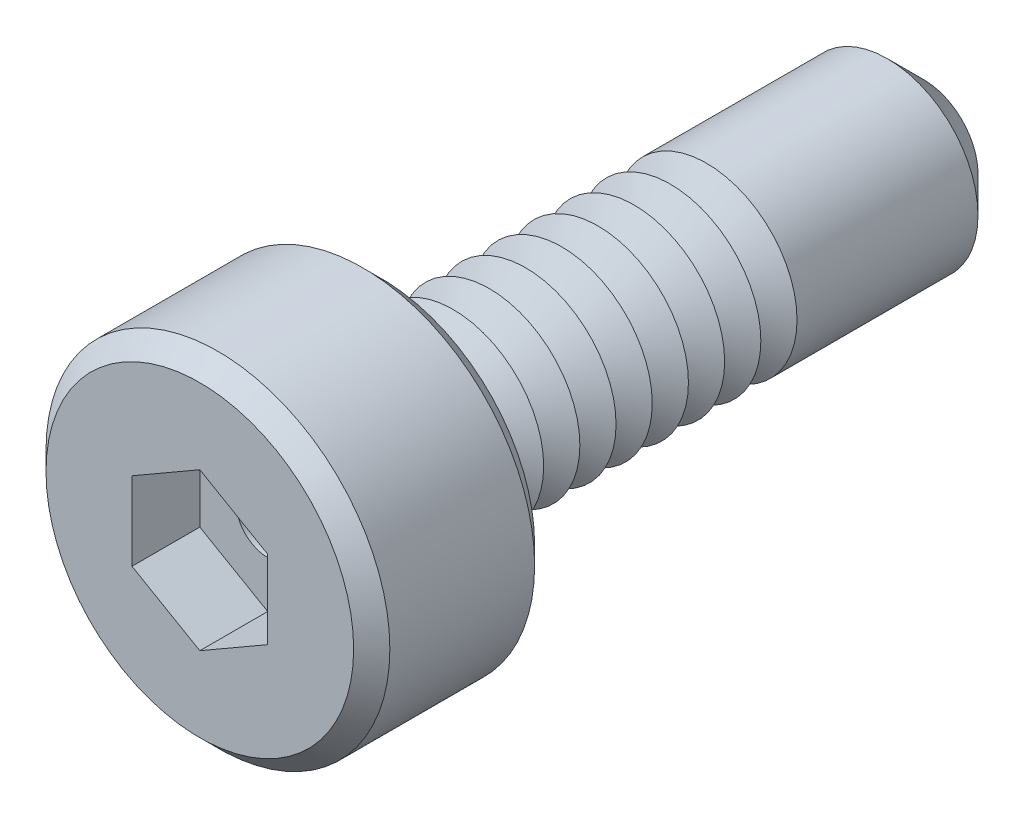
ISO-10303-21;
HEADER;
FILE_DESCRIPTION(('STEP AP214'),'2;1');
FILE_NAME('part.step','',(''),(''),'','','');
FILE_SCHEMA(('AUTOMOTIVE_DESIGN { 1 0 10303 214 1 1 1 1 }'));
ENDSEC;
DATA;
#1=APPLICATION_CONTEXT('core data for automotive mechanical design processes');
#2=APPLICATION_PROTOCOL_DEFINITION('international standard','automotive_design',2000,#1);
#3=PRODUCT_CONTEXT('',#1,'mechanical');
#4=PRODUCT('Part','Part','',(#3));
#5=PRODUCT_RELATED_PRODUCT_CATEGORY('part','',(#4));
#6=PRODUCT_DEFINITION_FORMATION('','',#4);
#7=PRODUCT_DEFINITION_CONTEXT('part definition',#1,'design');
#8=PRODUCT_DEFINITION('design','',#6,#7);
#9=PRODUCT_DEFINITION_SHAPE('','',#8);
#10=(LENGTH_UNIT() NAMED_UNIT(*) SI_UNIT(.MILLI.,.METRE.));
#11=(NAMED_UNIT(*) PLANE_ANGLE_UNIT() SI_UNIT($,.RADIAN.));
#12=(NAMED_UNIT(*) SI_UNIT($,.STERADIAN.) SOLID_ANGLE_UNIT());
#13=UNCERTAINTY_MEASURE_WITH_UNIT(LENGTH_MEASURE(1.E-05),#10,'distance_accuracy_value','');
#14=(GEOMETRIC_REPRESENTATION_CONTEXT(3) GLOBAL_UNCERTAINTY_ASSIGNED_CONTEXT((#13)) GLOBAL_UNIT_ASSIGNED_CONTEXT((#10,
#11,#12)) REPRESENTATION_CONTEXT('',''));
#15=CARTESIAN_POINT('',(0.,0.,0.));
#16=DIRECTION('',(0.,0.,1.));
#17=DIRECTION('',(1.,0.,0.));
#18=AXIS2_PLACEMENT_3D('',#15,#16,#17);
#19=CARTESIAN_POINT('',(0.,0.,2.));
#20=DIRECTION('',(0.,0.,-1.));
#21=DIRECTION('',(-1.,0.,0.));
#22=AXIS2_PLACEMENT_3D('',#19,#20,#21);
#23=CYLINDRICAL_SURFACE('',#22,1.9);
#24=CARTESIAN_POINT('',(0.,0.,0.2));
#25=DIRECTION('',(0.,0.,1.));
#26=DIRECTION('',(1.,0.,0.));
#27=AXIS2_PLACEMENT_3D('',#24,#25,#26);
#28=CIRCLE('',#27,1.9);
#29=CARTESIAN_POINT('',(1.9,0.,0.2));
#30=VERTEX_POINT('',#29);
#31=EDGE_CURVE('E252',#30,#30,#28,.T.);
#32=ORIENTED_EDGE('',*,*,#31,.T.);
#33=EDGE_LOOP('',(#32));
#34=FACE_BOUND('',#33,.T.);
#35=CARTESIAN_POINT('',(0.,0.,1.8));
#36=DIRECTION('',(0.,0.,1.));
#37=DIRECTION('',(1.,0.,0.));
#38=AXIS2_PLACEMENT_3D('',#35,#36,#37);
#39=CIRCLE('',#38,1.9);
#40=CARTESIAN_POINT('',(1.9,0.,1.8));
#41=VERTEX_POINT('',#40);
#42=EDGE_CURVE('E248',#41,#41,#39,.F.);
#43=ORIENTED_EDGE('',*,*,#42,.T.);
#44=EDGE_LOOP('',(#43));
#45=FACE_BOUND('',#44,.T.);
#46=ADVANCED_FACE('F39',(#34,#45),#23,.T.);
#47=CARTESIAN_POINT('',(0.,0.,2.));
#48=DIRECTION('',(0.,0.,1.));
#49=DIRECTION('',(1.,0.,0.));
#50=AXIS2_PLACEMENT_3D('',#47,#48,#49);
#51=PLANE('',#50);
#52=CARTESIAN_POINT('',(0.,0.,2.));
#53=DIRECTION('',(0.,0.,1.));
#54=DIRECTION('',(1.,0.,0.));
#55=AXIS2_PLACEMENT_3D('',#52,#53,#54);
#56=CIRCLE('',#55,1.7);
#57=CARTESIAN_POINT('',(1.7,0.,2.));
#58=VERTEX_POINT('',#57);
#59=EDGE_CURVE('E11',#58,#58,#56,.T.);
#60=ORIENTED_EDGE('',*,*,#59,.T.);
#61=EDGE_LOOP('',(#60));
#62=FACE_BOUND('',#61,.T.);
#63=DIRECTION('',(-0.866025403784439,0.5,0.));
#64=VECTOR('',#63,1.);
#65=CARTESIAN_POINT('',(0.749999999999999,0.433012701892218,2.));
#66=LINE('',#65,#64);
#67=CARTESIAN_POINT('',(0.749999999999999,0.433012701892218,2.));
#68=VERTEX_POINT('',#67);
#69=CARTESIAN_POINT('',(0.,0.866025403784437,2.));
#70=VERTEX_POINT('',#69);
#71=EDGE_CURVE('E55',#68,#70,#66,.T.);
#72=ORIENTED_EDGE('',*,*,#71,.F.);
#73=DIRECTION('',(0.,1.,0.));
#74=VECTOR('',#73,1.);
#75=CARTESIAN_POINT('',(0.75,-0.433012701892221,2.));
#76=LINE('',#75,#74);
#77=CARTESIAN_POINT('',(0.75,-0.433012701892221,2.));
#78=VERTEX_POINT('',#77);
#79=EDGE_CURVE('E150',#78,#68,#76,.T.);
#80=ORIENTED_EDGE('',*,*,#79,.F.);
#81=DIRECTION('',(0.866025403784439,0.5,0.));
#82=VECTOR('',#81,1.);
#83=CARTESIAN_POINT('',(0.,-0.86602540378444,2.));
#84=LINE('',#83,#82);
#85=CARTESIAN_POINT('',(0.,-0.86602540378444,2.));
#86=VERTEX_POINT('',#85);
#87=EDGE_CURVE('E147',#86,#78,#84,.T.);
#88=ORIENTED_EDGE('',*,*,#87,.F.);
#89=DIRECTION('',(0.866025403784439,-0.5,0.));
#90=VECTOR('',#89,1.);
#91=CARTESIAN_POINT('',(-0.75,-0.433012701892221,2.));
#92=LINE('',#91,#90);
#93=CARTESIAN_POINT('',(-0.75,-0.433012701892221,2.));
#94=VERTEX_POINT('',#93);
#95=EDGE_CURVE('E103',#94,#86,#92,.T.);
#96=ORIENTED_EDGE('',*,*,#95,.F.);
#97=DIRECTION('',(0.,-1.,0.));
#98=VECTOR('',#97,1.);
#99=CARTESIAN_POINT('',(-0.75,0.433012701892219,2.));
#100=LINE('',#99,#98);
#101=CARTESIAN_POINT('',(-0.75,0.433012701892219,2.));
#102=VERTEX_POINT('',#101);
#103=EDGE_CURVE('E141',#102,#94,#100,.T.);
#104=ORIENTED_EDGE('',*,*,#103,.F.);
#105=DIRECTION('',(-0.866025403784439,-0.499999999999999,0.));
#106=VECTOR('',#105,1.);
#107=CARTESIAN_POINT('',(0.,0.866025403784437,2.));
#108=LINE('',#107,#106);
#109=EDGE_CURVE('E136',#70,#102,#108,.T.);
#110=ORIENTED_EDGE('',*,*,#109,.F.);
#111=EDGE_LOOP('',(#72,#80,#88,#96,#104,#110));
#112=FACE_BOUND('',#111,.T.);
#113=ADVANCED_FACE('F270',(#62,#112),#51,.T.);
#114=CARTESIAN_POINT('',(0.,0.,0.));
#115=DIRECTION('',(0.,0.,1.));
#116=DIRECTION('',(1.,0.,0.));
#117=AXIS2_PLACEMENT_3D('',#114,#115,#116);
#118=PLANE('',#117);
#119=CARTESIAN_POINT('',(0.,0.,0.));
#120=DIRECTION('',(0.,0.,1.));
#121=DIRECTION('',(1.,0.,0.));
#122=AXIS2_PLACEMENT_3D('',#119,#120,#121);
#123=CIRCLE('',#122,1.7);
#124=CARTESIAN_POINT('',(1.7,0.,0.));
#125=VERTEX_POINT('',#124);
#126=EDGE_CURVE('E48',#125,#125,#123,.F.);
#127=ORIENTED_EDGE('',*,*,#126,.T.);
#128=EDGE_LOOP('',(#127));
#129=FACE_BOUND('',#128,.T.);
#130=CARTESIAN_POINT('',(0.,0.,0.));
#131=DIRECTION('',(0.,0.,1.));
#132=DIRECTION('',(1.,0.,0.));
#133=AXIS2_PLACEMENT_3D('',#130,#131,#132);
#134=CIRCLE('',#133,1.);
#135=CARTESIAN_POINT('',(1.,0.,0.));
#136=VERTEX_POINT('',#135);
#137=EDGE_CURVE('E237',#136,#136,#134,.T.);
#138=ORIENTED_EDGE('',*,*,#137,.T.);
#139=EDGE_LOOP('',(#138));
#140=FACE_BOUND('',#139,.T.);
#141=ADVANCED_FACE('F259',(#129,#140),#118,.F.);
#142=CARTESIAN_POINT('',(0.,0.,0.));
#143=DIRECTION('',(0.,0.,1.));
#144=DIRECTION('',(1.,0.,0.));
#145=AXIS2_PLACEMENT_3D('',#142,#143,#144);
#146=CONICAL_SURFACE('',#145,1.,1.0471975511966);
#147=CARTESIAN_POINT('',(0.,0.,-0.200000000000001));
#148=DIRECTION('',(0.,0.,1.));
#149=DIRECTION('',(1.,0.,0.));
#150=AXIS2_PLACEMENT_3D('',#147,#148,#149);
#151=CIRCLE('',#150,0.653589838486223);
#152=CARTESIAN_POINT('',(0.653589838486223,0.,-0.200000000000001));
#153=VERTEX_POINT('',#152);
#154=EDGE_CURVE('E233',#153,#153,#151,.T.);
#155=ORIENTED_EDGE('',*,*,#154,.T.);
#156=EDGE_LOOP('',(#155));
#157=FACE_BOUND('',#156,.T.);
#158=ORIENTED_EDGE('',*,*,#137,.F.);
#159=EDGE_LOOP('',(#158));
#160=FACE_BOUND('',#159,.T.);
#161=ADVANCED_FACE('F392',(#157,#160),#146,.T.);
#162=CARTESIAN_POINT('',(0.,0.,-0.200000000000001));
#163=DIRECTION('',(0.,0.,-1.));
#164=DIRECTION('',(-1.,0.,0.));
#165=AXIS2_PLACEMENT_3D('',#162,#163,#164);
#166=CONICAL_SURFACE('',#165,0.653589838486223,1.0471975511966);
#167=CARTESIAN_POINT('',(0.,0.,-0.4));
#168=DIRECTION('',(0.,0.,1.));
#169=DIRECTION('',(1.,0.,0.));
#170=AXIS2_PLACEMENT_3D('',#167,#168,#169);
#171=CIRCLE('',#170,1.);
#172=CARTESIAN_POINT('',(1.,0.,-0.4));
#173=VERTEX_POINT('',#172);
#174=EDGE_CURVE('E229',#173,#173,#171,.T.);
#175=ORIENTED_EDGE('',*,*,#174,.T.);
#176=EDGE_LOOP('',(#175));
#177=FACE_BOUND('',#176,.T.);
#178=ORIENTED_EDGE('',*,*,#154,.F.);
#179=EDGE_LOOP('',(#178));
#180=FACE_BOUND('',#179,.T.);
#181=ADVANCED_FACE('F388',(#177,#180),#166,.T.);
#182=CARTESIAN_POINT('',(0.,0.,-0.4));
#183=DIRECTION('',(0.,0.,1.));
#184=DIRECTION('',(1.,0.,0.));
#185=AXIS2_PLACEMENT_3D('',#182,#183,#184);
#186=CONICAL_SURFACE('',#185,1.,1.0471975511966);
#187=CARTESIAN_POINT('',(0.,0.,-0.600000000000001));
#188=DIRECTION('',(0.,0.,1.));
#189=DIRECTION('',(1.,0.,0.));
#190=AXIS2_PLACEMENT_3D('',#187,#188,#189);
#191=CIRCLE('',#190,0.653589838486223);
#192=CARTESIAN_POINT('',(0.653589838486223,0.,-0.600000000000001));
#193=VERTEX_POINT('',#192);
#194=EDGE_CURVE('E225',#193,#193,#191,.T.);
#195=ORIENTED_EDGE('',*,*,#194,.T.);
#196=EDGE_LOOP('',(#195));
#197=FACE_BOUND('',#196,.T.);
#198=ORIENTED_EDGE('',*,*,#174,.F.);
#199=EDGE_LOOP('',(#198));
#200=FACE_BOUND('',#199,.T.);
#201=ADVANCED_FACE('F384',(#197,#200),#186,.T.);
#202=CARTESIAN_POINT('',(0.,0.,-0.600000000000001));
#203=DIRECTION('',(0.,0.,-1.));
#204=DIRECTION('',(-1.,0.,0.));
#205=AXIS2_PLACEMENT_3D('',#202,#203,#204);
#206=CONICAL_SURFACE('',#205,0.653589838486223,1.0471975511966);
#207=CARTESIAN_POINT('',(0.,0.,-0.8));
#208=DIRECTION('',(0.,0.,1.));
#209=DIRECTION('',(1.,0.,0.));
#210=AXIS2_PLACEMENT_3D('',#207,#208,#209);
#211=CIRCLE('',#210,1.);
#212=CARTESIAN_POINT('',(1.,0.,-0.8));
#213=VERTEX_POINT('',#212);
#214=EDGE_CURVE('E221',#213,#213,#211,.T.);
#215=ORIENTED_EDGE('',*,*,#214,.T.);
#216=EDGE_LOOP('',(#215));
#217=FACE_BOUND('',#216,.T.);
#218=ORIENTED_EDGE('',*,*,#194,.F.);
#219=EDGE_LOOP('',(#218));
#220=FACE_BOUND('',#219,.T.);
#221=ADVANCED_FACE('F380',(#217,#220),#206,.T.);
#222=CARTESIAN_POINT('',(0.,0.,-0.8));
#223=DIRECTION('',(0.,0.,1.));
#224=DIRECTION('',(1.,0.,0.));
#225=AXIS2_PLACEMENT_3D('',#222,#223,#224);
#226=CONICAL_SURFACE('',#225,1.,1.0471975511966);
#227=CARTESIAN_POINT('',(0.,0.,-1.));
#228=DIRECTION('',(0.,0.,1.));
#229=DIRECTION('',(1.,0.,0.));
#230=AXIS2_PLACEMENT_3D('',#227,#228,#229);
#231=CIRCLE('',#230,0.653589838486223);
#232=CARTESIAN_POINT('',(0.653589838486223,0.,-1.));
#233=VERTEX_POINT('',#232);
#234=EDGE_CURVE('E217',#233,#233,#231,.T.);
#235=ORIENTED_EDGE('',*,*,#234,.T.);
#236=EDGE_LOOP('',(#235));
#237=FACE_BOUND('',#236,.T.);
#238=ORIENTED_EDGE('',*,*,#214,.F.);
#239=EDGE_LOOP('',(#238));
#240=FACE_BOUND('',#239,.T.);
#241=ADVANCED_FACE('F376',(#237,#240),#226,.T.);
#242=CARTESIAN_POINT('',(0.,0.,-1.));
#243=DIRECTION('',(0.,0.,-1.));
#244=DIRECTION('',(-1.,0.,0.));
#245=AXIS2_PLACEMENT_3D('',#242,#243,#244);
#246=CONICAL_SURFACE('',#245,0.653589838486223,1.0471975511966);
#247=CARTESIAN_POINT('',(0.,0.,-1.2));
#248=DIRECTION('',(0.,0.,1.));
#249=DIRECTION('',(1.,0.,0.));
#250=AXIS2_PLACEMENT_3D('',#247,#248,#249);
#251=CIRCLE('',#250,1.);
#252=CARTESIAN_POINT('',(1.,0.,-1.2));
#253=VERTEX_POINT('',#252);
#254=EDGE_CURVE('E213',#253,#253,#251,.T.);
#255=ORIENTED_EDGE('',*,*,#254,.T.);
#256=EDGE_LOOP('',(#255));
#257=FACE_BOUND('',#256,.T.);
#258=ORIENTED_EDGE('',*,*,#234,.F.);
#259=EDGE_LOOP('',(#258));
#260=FACE_BOUND('',#259,.T.);
#261=ADVANCED_FACE('F372',(#257,#260),#246,.T.);
#262=CARTESIAN_POINT('',(0.,0.,-1.2));
#263=DIRECTION('',(0.,0.,1.));
#264=DIRECTION('',(1.,0.,0.));
#265=AXIS2_PLACEMENT_3D('',#262,#263,#264);
#266=CONICAL_SURFACE('',#265,1.,1.0471975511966);
#267=CARTESIAN_POINT('',(0.,0.,-1.4));
#268=DIRECTION('',(0.,0.,1.));
#269=DIRECTION('',(1.,0.,0.));
#270=AXIS2_PLACEMENT_3D('',#267,#268,#269);
#271=CIRCLE('',#270,0.653589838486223);
#272=CARTESIAN_POINT('',(0.653589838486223,0.,-1.4));
#273=VERTEX_POINT('',#272);
#274=EDGE_CURVE('E209',#273,#273,#271,.T.);
#275=ORIENTED_EDGE('',*,*,#274,.T.);
#276=EDGE_LOOP('',(#275));
#277=FACE_BOUND('',#276,.T.);
#278=ORIENTED_EDGE('',*,*,#254,.F.);
#279=EDGE_LOOP('',(#278));
#280=FACE_BOUND('',#279,.T.);
#281=ADVANCED_FACE('F368',(#277,#280),#266,.T.);
#282=CARTESIAN_POINT('',(0.,0.,-1.4));
#283=DIRECTION('',(0.,0.,-1.));
#284=DIRECTION('',(-1.,0.,0.));
#285=AXIS2_PLACEMENT_3D('',#282,#283,#284);
#286=CONICAL_SURFACE('',#285,0.653589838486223,1.0471975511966);
#287=CARTESIAN_POINT('',(0.,0.,-1.6));
#288=DIRECTION('',(0.,0.,1.));
#289=DIRECTION('',(1.,0.,0.));
#290=AXIS2_PLACEMENT_3D('',#287,#288,#289);
#291=CIRCLE('',#290,1.);
#292=CARTESIAN_POINT('',(1.,0.,-1.6));
#293=VERTEX_POINT('',#292);
#294=EDGE_CURVE('E205',#293,#293,#291,.T.);
#295=ORIENTED_EDGE('',*,*,#294,.T.);
#296=EDGE_LOOP('',(#295));
#297=FACE_BOUND('',#296,.T.);
#298=ORIENTED_EDGE('',*,*,#274,.F.);
#299=EDGE_LOOP('',(#298));
#300=FACE_BOUND('',#299,.T.);
#301=ADVANCED_FACE('F364',(#297,#300),#286,.T.);
#302=CARTESIAN_POINT('',(0.,0.,-1.6));
#303=DIRECTION('',(0.,0.,1.));
#304=DIRECTION('',(1.,0.,0.));
#305=AXIS2_PLACEMENT_3D('',#302,#303,#304);
#306=CONICAL_SURFACE('',#305,1.,1.0471975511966);
#307=CARTESIAN_POINT('',(0.,0.,-1.8));
#308=DIRECTION('',(0.,0.,1.));
#309=DIRECTION('',(1.,0.,0.));
#310=AXIS2_PLACEMENT_3D('',#307,#308,#309);
#311=CIRCLE('',#310,0.653589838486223);
#312=CARTESIAN_POINT('',(0.653589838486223,0.,-1.8));
#313=VERTEX_POINT('',#312);
#314=EDGE_CURVE('E201',#313,#313,#311,.T.);
#315=ORIENTED_EDGE('',*,*,#314,.T.);
#316=EDGE_LOOP('',(#315));
#317=FACE_BOUND('',#316,.T.);
#318=ORIENTED_EDGE('',*,*,#294,.F.);
#319=EDGE_LOOP('',(#318));
#320=FACE_BOUND('',#319,.T.);
#321=ADVANCED_FACE('F360',(#317,#320),#306,.T.);
#322=CARTESIAN_POINT('',(0.,0.,-1.8));
#323=DIRECTION('',(0.,0.,-1.));
#324=DIRECTION('',(-1.,0.,0.));
#325=AXIS2_PLACEMENT_3D('',#322,#323,#324);
#326=CONICAL_SURFACE('',#325,0.653589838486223,1.0471975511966);
#327=CARTESIAN_POINT('',(0.,0.,-2.));
#328=DIRECTION('',(0.,0.,1.));
#329=DIRECTION('',(1.,0.,0.));
#330=AXIS2_PLACEMENT_3D('',#327,#328,#329);
#331=CIRCLE('',#330,1.);
#332=CARTESIAN_POINT('',(1.,0.,-2.));
#333=VERTEX_POINT('',#332);
#334=EDGE_CURVE('E197',#333,#333,#331,.T.);
#335=ORIENTED_EDGE('',*,*,#334,.T.);
#336=EDGE_LOOP('',(#335));
#337=FACE_BOUND('',#336,.T.);
#338=ORIENTED_EDGE('',*,*,#314,.F.);
#339=EDGE_LOOP('',(#338));
#340=FACE_BOUND('',#339,.T.);
#341=ADVANCED_FACE('F356',(#337,#340),#326,.T.);
#342=CARTESIAN_POINT('',(0.,0.,-2.));
#343=DIRECTION('',(0.,0.,1.));
#344=DIRECTION('',(1.,0.,0.));
#345=AXIS2_PLACEMENT_3D('',#342,#343,#344);
#346=CONICAL_SURFACE('',#345,1.,1.0471975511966);
#347=CARTESIAN_POINT('',(0.,0.,-2.2));
#348=DIRECTION('',(0.,0.,1.));
#349=DIRECTION('',(1.,0.,0.));
#350=AXIS2_PLACEMENT_3D('',#347,#348,#349);
#351=CIRCLE('',#350,0.653589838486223);
#352=CARTESIAN_POINT('',(0.653589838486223,0.,-2.2));
#353=VERTEX_POINT('',#352);
#354=EDGE_CURVE('E193',#353,#353,#351,.T.);
#355=ORIENTED_EDGE('',*,*,#354,.T.);
#356=EDGE_LOOP('',(#355));
#357=FACE_BOUND('',#356,.T.);
#358=ORIENTED_EDGE('',*,*,#334,.F.);
#359=EDGE_LOOP('',(#358));
#360=FACE_BOUND('',#359,.T.);
#361=ADVANCED_FACE('F352',(#357,#360),#346,.T.);
#362=CARTESIAN_POINT('',(0.,0.,-2.2));
#363=DIRECTION('',(0.,0.,-1.));
#364=DIRECTION('',(-1.,0.,0.));
#365=AXIS2_PLACEMENT_3D('',#362,#363,#364);
#366=CONICAL_SURFACE('',#365,0.653589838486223,1.0471975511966);
#367=CARTESIAN_POINT('',(0.,0.,-2.4));
#368=DIRECTION('',(0.,0.,1.));
#369=DIRECTION('',(1.,0.,0.));
#370=AXIS2_PLACEMENT_3D('',#367,#368,#369);
#371=CIRCLE('',#370,1.);
#372=CARTESIAN_POINT('',(1.,0.,-2.4));
#373=VERTEX_POINT('',#372);
#374=EDGE_CURVE('E189',#373,#373,#371,.T.);
#375=ORIENTED_EDGE('',*,*,#374,.T.);
#376=EDGE_LOOP('',(#375));
#377=FACE_BOUND('',#376,.T.);
#378=ORIENTED_EDGE('',*,*,#354,.F.);
#379=EDGE_LOOP('',(#378));
#380=FACE_BOUND('',#379,.T.);
#381=ADVANCED_FACE('F348',(#377,#380),#366,.T.);
#382=CARTESIAN_POINT('',(0.,0.,-2.4));
#383=DIRECTION('',(0.,0.,1.));
#384=DIRECTION('',(1.,0.,0.));
#385=AXIS2_PLACEMENT_3D('',#382,#383,#384);
#386=CONICAL_SURFACE('',#385,1.,1.0471975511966);
#387=CARTESIAN_POINT('',(0.,0.,-2.6));
#388=DIRECTION('',(0.,0.,1.));
#389=DIRECTION('',(1.,0.,0.));
#390=AXIS2_PLACEMENT_3D('',#387,#388,#389);
#391=CIRCLE('',#390,0.653589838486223);
#392=CARTESIAN_POINT('',(0.653589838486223,0.,-2.6));
#393=VERTEX_POINT('',#392);
#394=EDGE_CURVE('E185',#393,#393,#391,.T.);
#395=ORIENTED_EDGE('',*,*,#394,.T.);
#396=EDGE_LOOP('',(#395));
#397=FACE_BOUND('',#396,.T.);
#398=ORIENTED_EDGE('',*,*,#374,.F.);
#399=EDGE_LOOP('',(#398));
#400=FACE_BOUND('',#399,.T.);
#401=ADVANCED_FACE('F344',(#397,#400),#386,.T.);
#402=CARTESIAN_POINT('',(0.,0.,-2.6));
#403=DIRECTION('',(0.,0.,-1.));
#404=DIRECTION('',(-1.,0.,0.));
#405=AXIS2_PLACEMENT_3D('',#402,#403,#404);
#406=CONICAL_SURFACE('',#405,0.653589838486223,1.0471975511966);
#407=CARTESIAN_POINT('',(0.,0.,-2.8));
#408=DIRECTION('',(0.,0.,1.));
#409=DIRECTION('',(1.,0.,0.));
#410=AXIS2_PLACEMENT_3D('',#407,#408,#409);
#411=CIRCLE('',#410,1.);
#412=CARTESIAN_POINT('',(1.,0.,-2.8));
#413=VERTEX_POINT('',#412);
#414=EDGE_CURVE('E181',#413,#413,#411,.T.);
#415=ORIENTED_EDGE('',*,*,#414,.T.);
#416=EDGE_LOOP('',(#415));
#417=FACE_BOUND('',#416,.T.);
#418=ORIENTED_EDGE('',*,*,#394,.F.);
#419=EDGE_LOOP('',(#418));
#420=FACE_BOUND('',#419,.T.);
#421=ADVANCED_FACE('F340',(#417,#420),#406,.T.);
#422=CARTESIAN_POINT('',(0.,0.,-2.8));
#423=DIRECTION('',(0.,0.,1.));
#424=DIRECTION('',(1.,0.,0.));
#425=AXIS2_PLACEMENT_3D('',#422,#423,#424);
#426=CONICAL_SURFACE('',#425,1.,1.0471975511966);
#427=CARTESIAN_POINT('',(0.,0.,-3.));
#428=DIRECTION('',(0.,0.,1.));
#429=DIRECTION('',(1.,0.,0.));
#430=AXIS2_PLACEMENT_3D('',#427,#428,#429);
#431=CIRCLE('',#430,0.653589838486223);
#432=CARTESIAN_POINT('',(0.653589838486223,0.,-3.));
#433=VERTEX_POINT('',#432);
#434=EDGE_CURVE('E177',#433,#433,#431,.T.);
#435=ORIENTED_EDGE('',*,*,#434,.T.);
#436=EDGE_LOOP('',(#435));
#437=FACE_BOUND('',#436,.T.);
#438=ORIENTED_EDGE('',*,*,#414,.F.);
#439=EDGE_LOOP('',(#438));
#440=FACE_BOUND('',#439,.T.);
#441=ADVANCED_FACE('F336',(#437,#440),#426,.T.);
#442=CARTESIAN_POINT('',(0.,0.,-3.));
#443=DIRECTION('',(0.,0.,-1.));
#444=DIRECTION('',(-1.,0.,0.));
#445=AXIS2_PLACEMENT_3D('',#442,#443,#444);
#446=CONICAL_SURFACE('',#445,0.653589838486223,1.0471975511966);
#447=CARTESIAN_POINT('',(0.,0.,-3.2));
#448=DIRECTION('',(0.,0.,1.));
#449=DIRECTION('',(1.,0.,0.));
#450=AXIS2_PLACEMENT_3D('',#447,#448,#449);
#451=CIRCLE('',#450,1.);
#452=CARTESIAN_POINT('',(1.,0.,-3.2));
#453=VERTEX_POINT('',#452);
#454=EDGE_CURVE('E173',#453,#453,#451,.T.);
#455=ORIENTED_EDGE('',*,*,#454,.T.);
#456=EDGE_LOOP('',(#455));
#457=FACE_BOUND('',#456,.T.);
#458=ORIENTED_EDGE('',*,*,#434,.F.);
#459=EDGE_LOOP('',(#458));
#460=FACE_BOUND('',#459,.T.);
#461=ADVANCED_FACE('F332',(#457,#460),#446,.T.);
#462=CARTESIAN_POINT('',(0.,0.,-3.2));
#463=DIRECTION('',(0.,0.,1.));
#464=DIRECTION('',(1.,0.,0.));
#465=AXIS2_PLACEMENT_3D('',#462,#463,#464);
#466=CONICAL_SURFACE('',#465,1.,1.0471975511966);
#467=CARTESIAN_POINT('',(0.,0.,-3.4));
#468=DIRECTION('',(0.,0.,1.));
#469=DIRECTION('',(1.,0.,0.));
#470=AXIS2_PLACEMENT_3D('',#467,#468,#469);
#471=CIRCLE('',#470,0.653589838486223);
#472=CARTESIAN_POINT('',(0.653589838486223,0.,-3.4));
#473=VERTEX_POINT('',#472);
#474=EDGE_CURVE('E169',#473,#473,#471,.T.);
#475=ORIENTED_EDGE('',*,*,#474,.T.);
#476=EDGE_LOOP('',(#475));
#477=FACE_BOUND('',#476,.T.);
#478=ORIENTED_EDGE('',*,*,#454,.F.);
#479=EDGE_LOOP('',(#478));
#480=FACE_BOUND('',#479,.T.);
#481=ADVANCED_FACE('F328',(#477,#480),#466,.T.);
#482=CARTESIAN_POINT('',(0.,0.,-3.4));
#483=DIRECTION('',(0.,0.,-1.));
#484=DIRECTION('',(-1.,0.,0.));
#485=AXIS2_PLACEMENT_3D('',#482,#483,#484);
#486=CONICAL_SURFACE('',#485,0.653589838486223,1.0471975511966);
#487=CARTESIAN_POINT('',(0.,0.,-3.6));
#488=DIRECTION('',(0.,0.,1.));
#489=DIRECTION('',(1.,0.,0.));
#490=AXIS2_PLACEMENT_3D('',#487,#488,#489);
#491=CIRCLE('',#490,1.);
#492=CARTESIAN_POINT('',(1.,0.,-3.6));
#493=VERTEX_POINT('',#492);
#494=EDGE_CURVE('E156',#493,#493,#491,.T.);
#495=ORIENTED_EDGE('',*,*,#494,.T.);
#496=EDGE_LOOP('',(#495));
#497=FACE_BOUND('',#496,.T.);
#498=ORIENTED_EDGE('',*,*,#474,.F.);
#499=EDGE_LOOP('',(#498));
#500=FACE_BOUND('',#499,.T.);
#501=ADVANCED_FACE('F324',(#497,#500),#486,.T.);
#502=CARTESIAN_POINT('',(0.,0.,-6.));
#503=DIRECTION('',(0.,0.,-1.));
#504=DIRECTION('',(-1.,0.,0.));
#505=AXIS2_PLACEMENT_3D('',#502,#503,#504);
#506=PLANE('',#505);
#507=CARTESIAN_POINT('',(0.,0.,-6.));
#508=DIRECTION('',(0.,0.,-1.));
#509=DIRECTION('',(-1.,0.,0.));
#510=AXIS2_PLACEMENT_3D('',#507,#508,#509);
#511=CIRCLE('',#510,0.35);
#512=CARTESIAN_POINT('',(-0.35,0.,-6.));
#513=VERTEX_POINT('',#512);
#514=EDGE_CURVE('E137',#513,#513,#511,.F.);
#515=ORIENTED_EDGE('',*,*,#514,.T.);
#516=EDGE_LOOP('',(#515));
#517=FACE_BOUND('',#516,.T.);
#518=CARTESIAN_POINT('',(0.,0.,-6.));
#519=DIRECTION('',(0.,0.,-1.));
#520=DIRECTION('',(-1.,0.,0.));
#521=AXIS2_PLACEMENT_3D('',#518,#519,#520);
#522=CIRCLE('',#521,0.599999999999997);
#523=CARTESIAN_POINT('',(-0.599999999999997,0.,-6.));
#524=VERTEX_POINT('',#523);
#525=EDGE_CURVE('E241',#524,#524,#522,.T.);
#526=ORIENTED_EDGE('',*,*,#525,.T.);
#527=EDGE_LOOP('',(#526));
#528=FACE_BOUND('',#527,.T.);
#529=ADVANCED_FACE('F327',(#517,#528),#506,.T.);
#530=CARTESIAN_POINT('',(0.,0.,-6.));
#531=DIRECTION('',(0.,0.,1.));
#532=DIRECTION('',(1.,0.,0.));
#533=AXIS2_PLACEMENT_3D('',#530,#531,#532);
#534=CONICAL_SURFACE('',#533,0.599999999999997,0.785398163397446);
#535=CARTESIAN_POINT('',(0.,0.,-5.6));
#536=DIRECTION('',(0.,0.,-1.));
#537=DIRECTION('',(-1.,0.,0.));
#538=AXIS2_PLACEMENT_3D('',#535,#536,#537);
#539=CIRCLE('',#538,1.);
#540=CARTESIAN_POINT('',(-1.,0.,-5.6));
#541=VERTEX_POINT('',#540);
#542=EDGE_CURVE('E244',#541,#541,#539,.F.);
#543=ORIENTED_EDGE('',*,*,#542,.F.);
#544=EDGE_LOOP('',(#543));
#545=FACE_BOUND('',#544,.T.);
#546=ORIENTED_EDGE('',*,*,#525,.F.);
#547=EDGE_LOOP('',(#546));
#548=FACE_BOUND('',#547,.T.);
#549=ADVANCED_FACE('F399',(#545,#548),#534,.T.);
#550=CARTESIAN_POINT('',(0.,0.,-6.));
#551=DIRECTION('',(0.,0.,1.));
#552=DIRECTION('',(1.,0.,0.));
#553=AXIS2_PLACEMENT_3D('',#550,#551,#552);
#554=CYLINDRICAL_SURFACE('',#553,1.);
#555=ORIENTED_EDGE('',*,*,#542,.T.);
#556=EDGE_LOOP('',(#555));
#557=FACE_BOUND('',#556,.T.);
#558=ORIENTED_EDGE('',*,*,#494,.F.);
#559=EDGE_LOOP('',(#558));
#560=FACE_BOUND('',#559,.T.);
#561=ADVANCED_FACE('F323',(#557,#560),#554,.T.);
#562=CARTESIAN_POINT('',(0.749999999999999,0.433012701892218,1.25));
#563=DIRECTION('',(0.5,0.866025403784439,0.));
#564=DIRECTION('',(-0.866025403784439,0.5,0.));
#565=AXIS2_PLACEMENT_3D('',#562,#563,#564);
#566=PLANE('',#565);
#567=ORIENTED_EDGE('',*,*,#71,.T.);
#568=DIRECTION('',(0.,0.,1.));
#569=VECTOR('',#568,1.);
#570=CARTESIAN_POINT('',(0.,0.866025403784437,1.25));
#571=LINE('',#570,#569);
#572=CARTESIAN_POINT('',(0.,0.866025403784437,1.25));
#573=VERTEX_POINT('',#572);
#574=EDGE_CURVE('E85',#573,#70,#571,.T.);
#575=ORIENTED_EDGE('',*,*,#574,.F.);
#576=DIRECTION('',(-0.866025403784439,0.5,0.));
#577=VECTOR('',#576,1.);
#578=CARTESIAN_POINT('',(0.749999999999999,0.433012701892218,1.25));
#579=LINE('',#578,#577);
#580=CARTESIAN_POINT('',(0.749999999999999,0.433012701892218,1.25));
#581=VERTEX_POINT('',#580);
#582=EDGE_CURVE('E153',#581,#573,#579,.T.);
#583=ORIENTED_EDGE('',*,*,#582,.F.);
#584=DIRECTION('',(0.,0.,1.));
#585=VECTOR('',#584,1.);
#586=CARTESIAN_POINT('',(0.749999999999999,0.433012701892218,1.25));
#587=LINE('',#586,#585);
#588=EDGE_CURVE('E63',#581,#68,#587,.T.);
#589=ORIENTED_EDGE('',*,*,#588,.T.);
#590=EDGE_LOOP('',(#567,#575,#583,#589));
#591=FACE_BOUND('',#590,.T.);
#592=ADVANCED_FACE('F313',(#591),#566,.F.);
#593=CARTESIAN_POINT('',(0.75,-0.433012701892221,1.25));
#594=DIRECTION('',(1.,0.,0.));
#595=DIRECTION('',(0.,1.,0.));
#596=AXIS2_PLACEMENT_3D('',#593,#594,#595);
#597=PLANE('',#596);
#598=ORIENTED_EDGE('',*,*,#79,.T.);
#599=ORIENTED_EDGE('',*,*,#588,.F.);
#600=DIRECTION('',(0.,1.,0.));
#601=VECTOR('',#600,1.);
#602=CARTESIAN_POINT('',(0.75,-0.433012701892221,1.25));
#603=LINE('',#602,#601);
#604=CARTESIAN_POINT('',(0.75,-0.433012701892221,1.25));
#605=VERTEX_POINT('',#604);
#606=EDGE_CURVE('E117',#605,#581,#603,.T.);
#607=ORIENTED_EDGE('',*,*,#606,.F.);
#608=DIRECTION('',(0.,0.,1.));
#609=VECTOR('',#608,1.);
#610=CARTESIAN_POINT('',(0.75,-0.433012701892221,1.25));
#611=LINE('',#610,#609);
#612=EDGE_CURVE('E108',#605,#78,#611,.T.);
#613=ORIENTED_EDGE('',*,*,#612,.T.);
#614=EDGE_LOOP('',(#598,#599,#607,#613));
#615=FACE_BOUND('',#614,.T.);
#616=ADVANCED_FACE('F310',(#615),#597,.F.);
#617=CARTESIAN_POINT('',(0.,-0.86602540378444,1.25));
#618=DIRECTION('',(0.5,-0.866025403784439,0.));
#619=DIRECTION('',(0.866025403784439,0.5,0.));
#620=AXIS2_PLACEMENT_3D('',#617,#618,#619);
#621=PLANE('',#620);
#622=ORIENTED_EDGE('',*,*,#87,.T.);
#623=ORIENTED_EDGE('',*,*,#612,.F.);
#624=DIRECTION('',(0.866025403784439,0.5,0.));
#625=VECTOR('',#624,1.);
#626=CARTESIAN_POINT('',(0.,-0.86602540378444,1.25));
#627=LINE('',#626,#625);
#628=CARTESIAN_POINT('',(0.,-0.86602540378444,1.25));
#629=VERTEX_POINT('',#628);
#630=EDGE_CURVE('E112',#629,#605,#627,.T.);
#631=ORIENTED_EDGE('',*,*,#630,.F.);
#632=DIRECTION('',(0.,0.,1.));
#633=VECTOR('',#632,1.);
#634=CARTESIAN_POINT('',(0.,-0.86602540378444,1.25));
#635=LINE('',#634,#633);
#636=EDGE_CURVE('E96',#629,#86,#635,.T.);
#637=ORIENTED_EDGE('',*,*,#636,.T.);
#638=EDGE_LOOP('',(#622,#623,#631,#637));
#639=FACE_BOUND('',#638,.T.);
#640=ADVANCED_FACE('F113',(#639),#621,.F.);
#641=CARTESIAN_POINT('',(-0.75,-0.433012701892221,1.25));
#642=DIRECTION('',(-0.5,-0.866025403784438,0.));
#643=DIRECTION('',(0.866025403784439,-0.5,0.));
#644=AXIS2_PLACEMENT_3D('',#641,#642,#643);
#645=PLANE('',#644);
#646=ORIENTED_EDGE('',*,*,#95,.T.);
#647=ORIENTED_EDGE('',*,*,#636,.F.);
#648=DIRECTION('',(0.866025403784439,-0.5,0.));
#649=VECTOR('',#648,1.);
#650=CARTESIAN_POINT('',(-0.75,-0.433012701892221,1.25));
#651=LINE('',#650,#649);
#652=CARTESIAN_POINT('',(-0.75,-0.433012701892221,1.25));
#653=VERTEX_POINT('',#652);
#654=EDGE_CURVE('E100',#653,#629,#651,.T.);
#655=ORIENTED_EDGE('',*,*,#654,.F.);
#656=DIRECTION('',(0.,0.,1.));
#657=VECTOR('',#656,1.);
#658=CARTESIAN_POINT('',(-0.75,-0.433012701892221,1.25));
#659=LINE('',#658,#657);
#660=EDGE_CURVE('E109',#653,#94,#659,.T.);
#661=ORIENTED_EDGE('',*,*,#660,.T.);
#662=EDGE_LOOP('',(#646,#647,#655,#661));
#663=FACE_BOUND('',#662,.T.);
#664=ADVANCED_FACE('F98',(#663),#645,.F.);
#665=CARTESIAN_POINT('',(-0.75,0.433012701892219,1.25));
#666=DIRECTION('',(-1.,0.,0.));
#667=DIRECTION('',(0.,0.,1.));
#668=AXIS2_PLACEMENT_3D('',#665,#666,#667);
#669=PLANE('',#668);
#670=ORIENTED_EDGE('',*,*,#103,.T.);
#671=ORIENTED_EDGE('',*,*,#660,.F.);
#672=DIRECTION('',(0.,-1.,0.));
#673=VECTOR('',#672,1.);
#674=CARTESIAN_POINT('',(-0.75,0.433012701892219,1.25));
#675=LINE('',#674,#673);
#676=CARTESIAN_POINT('',(-0.75,0.433012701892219,1.25));
#677=VERTEX_POINT('',#676);
#678=EDGE_CURVE('E123',#677,#653,#675,.T.);
#679=ORIENTED_EDGE('',*,*,#678,.F.);
#680=DIRECTION('',(0.,0.,1.));
#681=VECTOR('',#680,1.);
#682=CARTESIAN_POINT('',(-0.75,0.433012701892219,1.25));
#683=LINE('',#682,#681);
#684=EDGE_CURVE('E161',#677,#102,#683,.T.);
#685=ORIENTED_EDGE('',*,*,#684,.T.);
#686=EDGE_LOOP('',(#670,#671,#679,#685));
#687=FACE_BOUND('',#686,.T.);
#688=ADVANCED_FACE('F307',(#687),#669,.F.);
#689=CARTESIAN_POINT('',(0.,0.866025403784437,1.25));
#690=DIRECTION('',(-0.499999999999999,0.866025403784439,0.));
#691=DIRECTION('',(-0.866025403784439,-0.499999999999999,0.));
#692=AXIS2_PLACEMENT_3D('',#689,#690,#691);
#693=PLANE('',#692);
#694=ORIENTED_EDGE('',*,*,#109,.T.);
#695=ORIENTED_EDGE('',*,*,#684,.F.);
#696=DIRECTION('',(-0.866025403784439,-0.499999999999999,0.));
#697=VECTOR('',#696,1.);
#698=CARTESIAN_POINT('',(0.,0.866025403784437,1.25));
#699=LINE('',#698,#697);
#700=EDGE_CURVE('E128',#573,#677,#699,.T.);
#701=ORIENTED_EDGE('',*,*,#700,.F.);
#702=ORIENTED_EDGE('',*,*,#574,.T.);
#703=EDGE_LOOP('',(#694,#695,#701,#702));
#704=FACE_BOUND('',#703,.T.);
#705=ADVANCED_FACE('F285',(#704),#693,.F.);
#706=CARTESIAN_POINT('',(0.,0.,1.25));
#707=DIRECTION('',(0.,0.,1.));
#708=DIRECTION('',(1.,0.,0.));
#709=AXIS2_PLACEMENT_3D('',#706,#707,#708);
#710=PLANE('',#709);
#711=CARTESIAN_POINT('',(0.,0.,1.25));
#712=DIRECTION('',(0.,0.,1.));
#713=DIRECTION('',(1.,0.,0.));
#714=AXIS2_PLACEMENT_3D('',#711,#712,#713);
#715=CIRCLE('',#714,0.35);
#716=CARTESIAN_POINT('',(0.35,0.,1.25));
#717=VERTEX_POINT('',#716);
#718=EDGE_CURVE('E293',#717,#717,#715,.T.);
#719=ORIENTED_EDGE('',*,*,#718,.F.);
#720=EDGE_LOOP('',(#719));
#721=FACE_BOUND('',#720,.T.);
#722=ORIENTED_EDGE('',*,*,#582,.T.);
#723=ORIENTED_EDGE('',*,*,#700,.T.);
#724=ORIENTED_EDGE('',*,*,#678,.T.);
#725=ORIENTED_EDGE('',*,*,#654,.T.);
#726=ORIENTED_EDGE('',*,*,#630,.T.);
#727=ORIENTED_EDGE('',*,*,#606,.T.);
#728=EDGE_LOOP('',(#722,#723,#724,#725,#726,#727));
#729=FACE_BOUND('',#728,.T.);
#730=ADVANCED_FACE('F120',(#721,#729),#710,.T.);
#731=CARTESIAN_POINT('',(0.,0.,-6.98994949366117));
#732=DIRECTION('',(0.,0.,1.));
#733=DIRECTION('',(1.,0.,0.));
#734=AXIS2_PLACEMENT_3D('',#731,#732,#733);
#735=CYLINDRICAL_SURFACE('',#734,0.35);
#736=ORIENTED_EDGE('',*,*,#718,.T.);
#737=EDGE_LOOP('',(#736));
#738=FACE_BOUND('',#737,.T.);
#739=ORIENTED_EDGE('',*,*,#514,.F.);
#740=EDGE_LOOP('',(#739));
#741=FACE_BOUND('',#740,.T.);
#742=ADVANCED_FACE('F265',(#738,#741),#735,.F.);
#743=CARTESIAN_POINT('',(0.,0.,0.2));
#744=DIRECTION('',(0.,0.,1.));
#745=DIRECTION('',(1.,0.,0.));
#746=AXIS2_PLACEMENT_3D('',#743,#744,#745);
#747=CONICAL_SURFACE('',#746,1.9,0.785398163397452);
#748=ORIENTED_EDGE('',*,*,#126,.F.);
#749=EDGE_LOOP('',(#748));
#750=FACE_BOUND('',#749,.T.);
#751=ORIENTED_EDGE('',*,*,#31,.F.);
#752=EDGE_LOOP('',(#751));
#753=FACE_BOUND('',#752,.T.);
#754=ADVANCED_FACE('F262',(#750,#753),#747,.T.);
#755=CARTESIAN_POINT('',(0.,0.,2.));
#756=DIRECTION('',(0.,0.,-1.));
#757=DIRECTION('',(-1.,0.,0.));
#758=AXIS2_PLACEMENT_3D('',#755,#756,#757);
#759=CONICAL_SURFACE('',#758,1.7,0.785398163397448);
#760=ORIENTED_EDGE('',*,*,#42,.F.);
#761=EDGE_LOOP('',(#760));
#762=FACE_BOUND('',#761,.T.);
#763=ORIENTED_EDGE('',*,*,#59,.F.);
#764=EDGE_LOOP('',(#763));
#765=FACE_BOUND('',#764,.T.);
#766=ADVANCED_FACE('F41',(#762,#765),#759,.T.);
#767=CLOSED_SHELL('',(#46,#113,#141,#161,#181,#201,#221,#241,#261,#281,#301,#321,#341,#361,#381,
#401,#421,#441,#461,#481,#501,#529,#549,#561,#592,#616,#640,#664,#688,#705,#730,#742,#754,#766));
#768=MANIFOLD_SOLID_BREP('B2',#767);
#769=ADVANCED_BREP_SHAPE_REPRESENTATION('',(#18,#768),#14);
#770=SHAPE_DEFINITION_REPRESENTATION(#9,#769);
ENDSEC;
END-ISO-10303-21;
